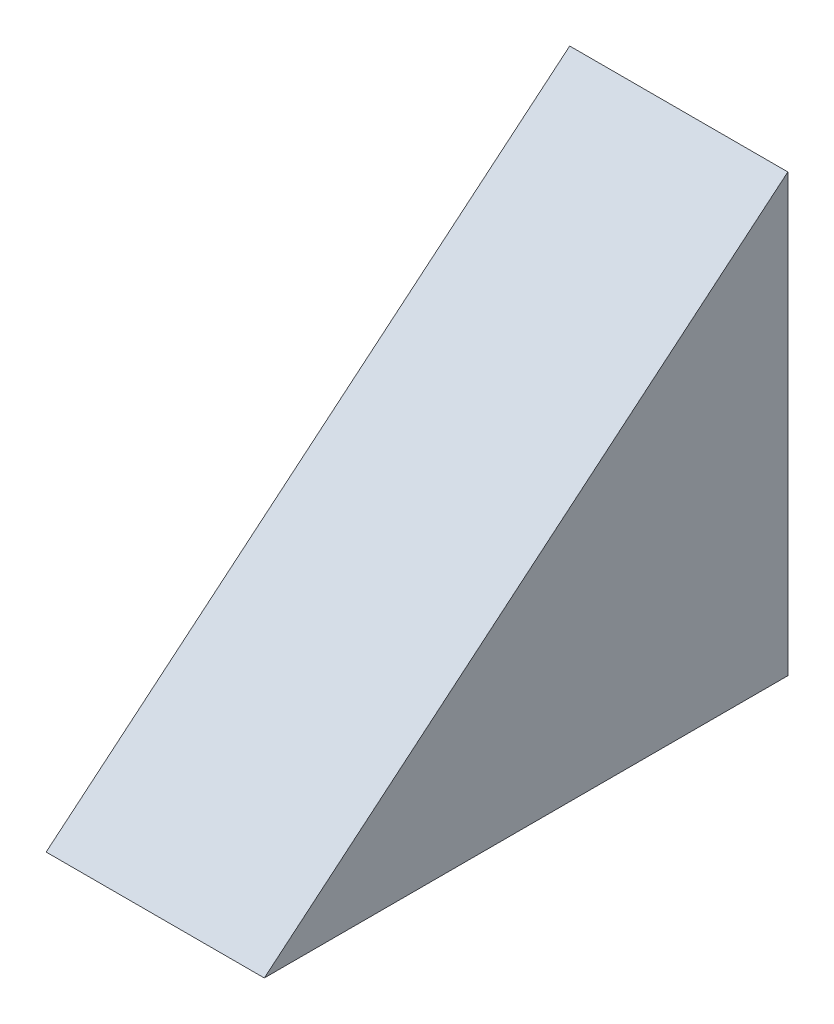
ISO-10303-21;
HEADER;
FILE_DESCRIPTION(('STEP AP214'),'2;1');
FILE_NAME('part.step','',(''),(''),'','','');
FILE_SCHEMA(('AUTOMOTIVE_DESIGN { 1 0 10303 214 1 1 1 1 }'));
ENDSEC;
DATA;
#1=APPLICATION_CONTEXT('core data for automotive mechanical design processes');
#2=APPLICATION_PROTOCOL_DEFINITION('international standard','automotive_design',2000,#1);
#3=PRODUCT_CONTEXT('',#1,'mechanical');
#4=PRODUCT('Part','Part','',(#3));
#5=PRODUCT_RELATED_PRODUCT_CATEGORY('part','',(#4));
#6=PRODUCT_DEFINITION_FORMATION('','',#4);
#7=PRODUCT_DEFINITION_CONTEXT('part definition',#1,'design');
#8=PRODUCT_DEFINITION('design','',#6,#7);
#9=PRODUCT_DEFINITION_SHAPE('','',#8);
#10=(LENGTH_UNIT() NAMED_UNIT(*) SI_UNIT(.MILLI.,.METRE.));
#11=(NAMED_UNIT(*) PLANE_ANGLE_UNIT() SI_UNIT($,.RADIAN.));
#12=(NAMED_UNIT(*) SI_UNIT($,.STERADIAN.) SOLID_ANGLE_UNIT());
#13=UNCERTAINTY_MEASURE_WITH_UNIT(LENGTH_MEASURE(1.E-05),#10,'distance_accuracy_value','');
#14=(GEOMETRIC_REPRESENTATION_CONTEXT(3) GLOBAL_UNCERTAINTY_ASSIGNED_CONTEXT((#13)) GLOBAL_UNIT_ASSIGNED_CONTEXT((#10,
#11,#12)) REPRESENTATION_CONTEXT('',''));
#15=CARTESIAN_POINT('',(0.,0.,0.));
#16=DIRECTION('',(0.,0.,1.));
#17=DIRECTION('',(1.,0.,0.));
#18=AXIS2_PLACEMENT_3D('',#15,#16,#17);
#19=CARTESIAN_POINT('',(2.5,18.,8.));
#20=DIRECTION('',(0.,0.,1.));
#21=DIRECTION('',(1.,0.,0.));
#22=AXIS2_PLACEMENT_3D('',#19,#20,#21);
#23=PLANE('',#22);
#24=DIRECTION('',(0.,1.,0.));
#25=VECTOR('',#24,1.);
#26=CARTESIAN_POINT('',(-2.5,18.,8.));
#27=LINE('',#26,#25);
#28=CARTESIAN_POINT('',(-2.5,8.,8.));
#29=VERTEX_POINT('',#28);
#30=CARTESIAN_POINT('',(-2.5,18.,8.));
#31=VERTEX_POINT('',#30);
#32=EDGE_CURVE('E78',#29,#31,#27,.T.);
#33=ORIENTED_EDGE('',*,*,#32,.T.);
#34=DIRECTION('',(-1.,0.,0.));
#35=VECTOR('',#34,1.);
#36=CARTESIAN_POINT('',(2.5,18.,8.));
#37=LINE('',#36,#35);
#38=CARTESIAN_POINT('',(2.5,18.,8.));
#39=VERTEX_POINT('',#38);
#40=EDGE_CURVE('E11',#39,#31,#37,.T.);
#41=ORIENTED_EDGE('',*,*,#40,.F.);
#42=DIRECTION('',(0.,1.,0.));
#43=VECTOR('',#42,1.);
#44=CARTESIAN_POINT('',(2.5,18.,8.));
#45=LINE('',#44,#43);
#46=CARTESIAN_POINT('',(2.5,8.,8.));
#47=VERTEX_POINT('',#46);
#48=EDGE_CURVE('E71',#47,#39,#45,.T.);
#49=ORIENTED_EDGE('',*,*,#48,.F.);
#50=DIRECTION('',(-1.,0.,0.));
#51=VECTOR('',#50,1.);
#52=CARTESIAN_POINT('',(2.5,8.,8.));
#53=LINE('',#52,#51);
#54=EDGE_CURVE('E79',#47,#29,#53,.T.);
#55=ORIENTED_EDGE('',*,*,#54,.T.);
#56=EDGE_LOOP('',(#33,#41,#49,#55));
#57=FACE_BOUND('',#56,.T.);
#58=ADVANCED_FACE('F31',(#57),#23,.F.);
#59=CARTESIAN_POINT('',(2.5,18.,8.));
#60=DIRECTION('',(0.,-0.768221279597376,-0.64018439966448));
#61=DIRECTION('',(0.,0.64018439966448,-0.768221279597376));
#62=AXIS2_PLACEMENT_3D('',#59,#60,#61);
#63=PLANE('',#62);
#64=DIRECTION('',(0.,-0.64018439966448,0.768221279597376));
#65=VECTOR('',#64,1.);
#66=CARTESIAN_POINT('',(-2.5,18.,8.));
#67=LINE('',#66,#65);
#68=CARTESIAN_POINT('',(-2.5,8.,20.));
#69=VERTEX_POINT('',#68);
#70=EDGE_CURVE('E59',#31,#69,#67,.T.);
#71=ORIENTED_EDGE('',*,*,#70,.T.);
#72=DIRECTION('',(-1.,0.,0.));
#73=VECTOR('',#72,1.);
#74=CARTESIAN_POINT('',(2.5,8.,20.));
#75=LINE('',#74,#73);
#76=CARTESIAN_POINT('',(2.5,8.,20.));
#77=VERTEX_POINT('',#76);
#78=EDGE_CURVE('E39',#77,#69,#75,.T.);
#79=ORIENTED_EDGE('',*,*,#78,.F.);
#80=DIRECTION('',(0.,-0.64018439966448,0.768221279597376));
#81=VECTOR('',#80,1.);
#82=CARTESIAN_POINT('',(2.5,18.,8.));
#83=LINE('',#82,#81);
#84=EDGE_CURVE('E67',#39,#77,#83,.T.);
#85=ORIENTED_EDGE('',*,*,#84,.F.);
#86=ORIENTED_EDGE('',*,*,#40,.T.);
#87=EDGE_LOOP('',(#71,#79,#85,#86));
#88=FACE_BOUND('',#87,.T.);
#89=ADVANCED_FACE('F68',(#88),#63,.F.);
#90=CARTESIAN_POINT('',(2.5,8.,8.));
#91=DIRECTION('',(0.,1.,0.));
#92=DIRECTION('',(0.,0.,1.));
#93=AXIS2_PLACEMENT_3D('',#90,#91,#92);
#94=PLANE('',#93);
#95=DIRECTION('',(0.,0.,-1.));
#96=VECTOR('',#95,1.);
#97=CARTESIAN_POINT('',(-2.5,8.,8.));
#98=LINE('',#97,#96);
#99=EDGE_CURVE('E64',#69,#29,#98,.T.);
#100=ORIENTED_EDGE('',*,*,#99,.T.);
#101=ORIENTED_EDGE('',*,*,#54,.F.);
#102=DIRECTION('',(0.,0.,-1.));
#103=VECTOR('',#102,1.);
#104=CARTESIAN_POINT('',(2.5,8.,8.));
#105=LINE('',#104,#103);
#106=EDGE_CURVE('E47',#77,#47,#105,.T.);
#107=ORIENTED_EDGE('',*,*,#106,.F.);
#108=ORIENTED_EDGE('',*,*,#78,.T.);
#109=EDGE_LOOP('',(#100,#101,#107,#108));
#110=FACE_BOUND('',#109,.T.);
#111=ADVANCED_FACE('F86',(#110),#94,.F.);
#112=CARTESIAN_POINT('',(2.5,8.,8.));
#113=DIRECTION('',(-1.,0.,0.));
#114=DIRECTION('',(0.,0.,1.));
#115=AXIS2_PLACEMENT_3D('',#112,#113,#114);
#116=PLANE('',#115);
#117=ORIENTED_EDGE('',*,*,#48,.T.);
#118=ORIENTED_EDGE('',*,*,#84,.T.);
#119=ORIENTED_EDGE('',*,*,#106,.T.);
#120=EDGE_LOOP('',(#117,#118,#119));
#121=FACE_BOUND('',#120,.T.);
#122=ADVANCED_FACE('F74',(#121),#116,.F.);
#123=CARTESIAN_POINT('',(-2.5,8.,8.));
#124=DIRECTION('',(-1.,0.,0.));
#125=DIRECTION('',(0.,0.,1.));
#126=AXIS2_PLACEMENT_3D('',#123,#124,#125);
#127=PLANE('',#126);
#128=ORIENTED_EDGE('',*,*,#32,.F.);
#129=ORIENTED_EDGE('',*,*,#99,.F.);
#130=ORIENTED_EDGE('',*,*,#70,.F.);
#131=EDGE_LOOP('',(#128,#129,#130));
#132=FACE_BOUND('',#131,.T.);
#133=ADVANCED_FACE('F87',(#132),#127,.T.);
#134=CLOSED_SHELL('',(#58,#89,#111,#122,#133));
#135=MANIFOLD_SOLID_BREP('B2',#134);
#136=ADVANCED_BREP_SHAPE_REPRESENTATION('',(#18,#135),#14);
#137=SHAPE_DEFINITION_REPRESENTATION(#9,#136);
ENDSEC;
END-ISO-10303-21;
